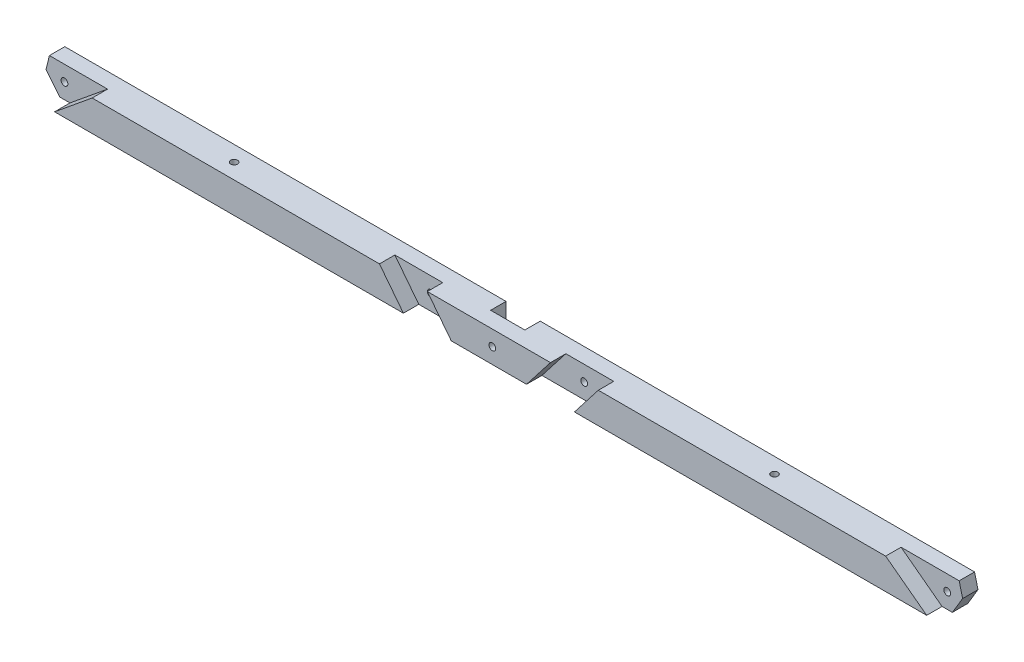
ISO-10303-21;
HEADER;
FILE_DESCRIPTION(('STEP AP214'),'2;1');
FILE_NAME('part.step','',(''),(''),'','','');
FILE_SCHEMA(('AUTOMOTIVE_DESIGN { 1 0 10303 214 1 1 1 1 }'));
ENDSEC;
DATA;
#1=APPLICATION_CONTEXT('core data for automotive mechanical design processes');
#2=APPLICATION_PROTOCOL_DEFINITION('international standard','automotive_design',2000,#1);
#3=PRODUCT_CONTEXT('',#1,'mechanical');
#4=PRODUCT('Part','Part','',(#3));
#5=PRODUCT_RELATED_PRODUCT_CATEGORY('part','',(#4));
#6=PRODUCT_DEFINITION_FORMATION('','',#4);
#7=PRODUCT_DEFINITION_CONTEXT('part definition',#1,'design');
#8=PRODUCT_DEFINITION('design','',#6,#7);
#9=PRODUCT_DEFINITION_SHAPE('','',#8);
#10=(LENGTH_UNIT() NAMED_UNIT(*) SI_UNIT(.MILLI.,.METRE.));
#11=(NAMED_UNIT(*) PLANE_ANGLE_UNIT() SI_UNIT($,.RADIAN.));
#12=(NAMED_UNIT(*) SI_UNIT($,.STERADIAN.) SOLID_ANGLE_UNIT());
#13=UNCERTAINTY_MEASURE_WITH_UNIT(LENGTH_MEASURE(1.E-05),#10,'distance_accuracy_value','');
#14=(GEOMETRIC_REPRESENTATION_CONTEXT(3) GLOBAL_UNCERTAINTY_ASSIGNED_CONTEXT((#13)) GLOBAL_UNIT_ASSIGNED_CONTEXT((#10,
#11,#12)) REPRESENTATION_CONTEXT('',''));
#15=CARTESIAN_POINT('',(0.,0.,0.));
#16=DIRECTION('',(0.,0.,1.));
#17=DIRECTION('',(1.,0.,0.));
#18=AXIS2_PLACEMENT_3D('',#15,#16,#17);
#19=CARTESIAN_POINT('',(0.,9.,0.));
#20=DIRECTION('',(0.,0.,-1.));
#21=DIRECTION('',(-1.,0.,0.));
#22=AXIS2_PLACEMENT_3D('',#19,#20,#21);
#23=PLANE('',#22);
#24=DIRECTION('',(0.,-1.,0.));
#25=VECTOR('',#24,1.);
#26=CARTESIAN_POINT('',(140.,0.,0.));
#27=LINE('',#26,#25);
#28=CARTESIAN_POINT('',(140.,9.,0.));
#29=VERTEX_POINT('',#28);
#30=CARTESIAN_POINT('',(140.,0.,0.));
#31=VERTEX_POINT('',#30);
#32=EDGE_CURVE('E187',#29,#31,#27,.T.);
#33=ORIENTED_EDGE('',*,*,#32,.F.);
#34=DIRECTION('',(-1.,0.,0.));
#35=VECTOR('',#34,1.);
#36=CARTESIAN_POINT('',(0.,9.,0.));
#37=LINE('',#36,#35);
#38=CARTESIAN_POINT('',(267.,9.,0.));
#39=VERTEX_POINT('',#38);
#40=EDGE_CURVE('E35',#39,#29,#37,.T.);
#41=ORIENTED_EDGE('',*,*,#40,.F.);
#42=DIRECTION('',(0.242535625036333,-0.970142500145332,0.));
#43=VECTOR('',#42,1.);
#44=CARTESIAN_POINT('',(268.,5.,0.));
#45=LINE('',#44,#43);
#46=CARTESIAN_POINT('',(268.,5.,0.));
#47=VERTEX_POINT('',#46);
#48=EDGE_CURVE('E240',#39,#47,#45,.T.);
#49=ORIENTED_EDGE('',*,*,#48,.T.);
#50=DIRECTION('',(-0.514495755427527,-0.857492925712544,0.));
#51=VECTOR('',#50,1.);
#52=CARTESIAN_POINT('',(268.,5.,0.));
#53=LINE('',#52,#51);
#54=CARTESIAN_POINT('',(265.,0.,0.));
#55=VERTEX_POINT('',#54);
#56=EDGE_CURVE('E247',#47,#55,#53,.T.);
#57=ORIENTED_EDGE('',*,*,#56,.T.);
#58=DIRECTION('',(1.,0.,0.));
#59=VECTOR('',#58,1.);
#60=CARTESIAN_POINT('',(0.,0.,0.));
#61=LINE('',#60,#59);
#62=EDGE_CURVE('E356',#31,#55,#61,.T.);
#63=ORIENTED_EDGE('',*,*,#62,.F.);
#64=EDGE_LOOP('',(#33,#41,#49,#57,#63));
#65=FACE_BOUND('',#64,.T.);
#66=CARTESIAN_POINT('',(157.368031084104,4.5,0.));
#67=DIRECTION('',(0.,0.,1.));
#68=DIRECTION('',(1.,0.,0.));
#69=AXIS2_PLACEMENT_3D('',#66,#67,#68);
#70=CIRCLE('',#69,0.999999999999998);
#71=CARTESIAN_POINT('',(158.368031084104,4.5,0.));
#72=VERTEX_POINT('',#71);
#73=EDGE_CURVE('E330',#72,#72,#70,.T.);
#74=ORIENTED_EDGE('',*,*,#73,.T.);
#75=EDGE_LOOP('',(#74));
#76=FACE_BOUND('',#75,.T.);
#77=CARTESIAN_POINT('',(263.5,4.5,0.));
#78=DIRECTION('',(0.,0.,1.));
#79=DIRECTION('',(1.,0.,0.));
#80=AXIS2_PLACEMENT_3D('',#77,#78,#79);
#81=CIRCLE('',#80,0.999999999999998);
#82=CARTESIAN_POINT('',(264.5,4.5,0.));
#83=VERTEX_POINT('',#82);
#84=EDGE_CURVE('E219',#83,#83,#81,.T.);
#85=ORIENTED_EDGE('',*,*,#84,.T.);
#86=EDGE_LOOP('',(#85));
#87=FACE_BOUND('',#86,.T.);
#88=ADVANCED_FACE('F31',(#65,#76,#87),#23,.T.);
#89=CARTESIAN_POINT('',(268.,5.,0.));
#90=DIRECTION('',(-0.857492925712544,0.514495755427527,0.));
#91=DIRECTION('',(-0.514495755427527,-0.857492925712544,0.));
#92=AXIS2_PLACEMENT_3D('',#89,#90,#91);
#93=PLANE('',#92);
#94=DIRECTION('',(0.514495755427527,0.857492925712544,0.));
#95=VECTOR('',#94,1.);
#96=CARTESIAN_POINT('',(265.,0.,4.5));
#97=LINE('',#96,#95);
#98=CARTESIAN_POINT('',(265.,0.,4.5));
#99=VERTEX_POINT('',#98);
#100=CARTESIAN_POINT('',(268.,5.,4.5));
#101=VERTEX_POINT('',#100);
#102=EDGE_CURVE('E57',#99,#101,#97,.T.);
#103=ORIENTED_EDGE('',*,*,#102,.F.);
#104=DIRECTION('',(0.,0.,1.));
#105=VECTOR('',#104,1.);
#106=CARTESIAN_POINT('',(265.,0.,0.));
#107=LINE('',#106,#105);
#108=EDGE_CURVE('E251',#55,#99,#107,.T.);
#109=ORIENTED_EDGE('',*,*,#108,.F.);
#110=ORIENTED_EDGE('',*,*,#56,.F.);
#111=DIRECTION('',(0.,0.,1.));
#112=VECTOR('',#111,1.);
#113=CARTESIAN_POINT('',(268.,5.,0.));
#114=LINE('',#113,#112);
#115=EDGE_CURVE('E250',#47,#101,#114,.T.);
#116=ORIENTED_EDGE('',*,*,#115,.T.);
#117=EDGE_LOOP('',(#103,#109,#110,#116));
#118=FACE_BOUND('',#117,.T.);
#119=ADVANCED_FACE('F376',(#118),#93,.F.);
#120=CARTESIAN_POINT('',(268.,5.,0.));
#121=DIRECTION('',(-0.970142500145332,-0.242535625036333,0.));
#122=DIRECTION('',(0.242535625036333,-0.970142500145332,0.));
#123=AXIS2_PLACEMENT_3D('',#120,#121,#122);
#124=PLANE('',#123);
#125=DIRECTION('',(-0.242535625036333,0.970142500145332,0.));
#126=VECTOR('',#125,1.);
#127=CARTESIAN_POINT('',(268.,5.,4.5));
#128=LINE('',#127,#126);
#129=CARTESIAN_POINT('',(267.,9.,4.5));
#130=VERTEX_POINT('',#129);
#131=EDGE_CURVE('E228',#101,#130,#128,.T.);
#132=ORIENTED_EDGE('',*,*,#131,.F.);
#133=ORIENTED_EDGE('',*,*,#115,.F.);
#134=ORIENTED_EDGE('',*,*,#48,.F.);
#135=DIRECTION('',(0.,0.,1.));
#136=VECTOR('',#135,1.);
#137=CARTESIAN_POINT('',(267.,9.,0.));
#138=LINE('',#137,#136);
#139=EDGE_CURVE('E244',#39,#130,#138,.T.);
#140=ORIENTED_EDGE('',*,*,#139,.T.);
#141=EDGE_LOOP('',(#132,#133,#134,#140));
#142=FACE_BOUND('',#141,.T.);
#143=ADVANCED_FACE('F382',(#142),#124,.F.);
#144=CARTESIAN_POINT('',(4.,0.,0.));
#145=DIRECTION('',(0.78086880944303,0.624695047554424,0.));
#146=DIRECTION('',(-0.624695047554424,0.78086880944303,0.));
#147=AXIS2_PLACEMENT_3D('',#144,#145,#146);
#148=PLANE('',#147);
#149=DIRECTION('',(0.624695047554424,-0.78086880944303,0.));
#150=VECTOR('',#149,1.);
#151=CARTESIAN_POINT('',(4.,0.,4.5));
#152=LINE('',#151,#150);
#153=CARTESIAN_POINT('',(0.,5.,4.5));
#154=VERTEX_POINT('',#153);
#155=CARTESIAN_POINT('',(4.,0.,4.5));
#156=VERTEX_POINT('',#155);
#157=EDGE_CURVE('E265',#154,#156,#152,.T.);
#158=ORIENTED_EDGE('',*,*,#157,.F.);
#159=DIRECTION('',(0.,0.,1.));
#160=VECTOR('',#159,1.);
#161=CARTESIAN_POINT('',(0.,5.,0.));
#162=LINE('',#161,#160);
#163=CARTESIAN_POINT('',(0.,5.,0.));
#164=VERTEX_POINT('',#163);
#165=EDGE_CURVE('E291',#164,#154,#162,.T.);
#166=ORIENTED_EDGE('',*,*,#165,.F.);
#167=DIRECTION('',(-0.624695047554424,0.78086880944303,0.));
#168=VECTOR('',#167,1.);
#169=CARTESIAN_POINT('',(4.,0.,0.));
#170=LINE('',#169,#168);
#171=CARTESIAN_POINT('',(4.,0.,0.));
#172=VERTEX_POINT('',#171);
#173=EDGE_CURVE('E287',#172,#164,#170,.T.);
#174=ORIENTED_EDGE('',*,*,#173,.F.);
#175=DIRECTION('',(0.,0.,1.));
#176=VECTOR('',#175,1.);
#177=CARTESIAN_POINT('',(4.,0.,0.));
#178=LINE('',#177,#176);
#179=EDGE_CURVE('E290',#172,#156,#178,.T.);
#180=ORIENTED_EDGE('',*,*,#179,.T.);
#181=EDGE_LOOP('',(#158,#166,#174,#180));
#182=FACE_BOUND('',#181,.T.);
#183=ADVANCED_FACE('F506',(#182),#148,.F.);
#184=CARTESIAN_POINT('',(0.,5.,0.));
#185=DIRECTION('',(0.970142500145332,-0.242535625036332,0.));
#186=DIRECTION('',(0.242535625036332,0.970142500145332,0.));
#187=AXIS2_PLACEMENT_3D('',#184,#185,#186);
#188=PLANE('',#187);
#189=DIRECTION('',(-0.242535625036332,-0.970142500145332,0.));
#190=VECTOR('',#189,1.);
#191=CARTESIAN_POINT('',(0.,5.,4.5));
#192=LINE('',#191,#190);
#193=CARTESIAN_POINT('',(1.,9.00000000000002,4.5));
#194=VERTEX_POINT('',#193);
#195=EDGE_CURVE('E263',#194,#154,#192,.T.);
#196=ORIENTED_EDGE('',*,*,#195,.F.);
#197=DIRECTION('',(0.,0.,1.));
#198=VECTOR('',#197,1.);
#199=CARTESIAN_POINT('',(1.,9.00000000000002,0.));
#200=LINE('',#199,#198);
#201=CARTESIAN_POINT('',(1.,9.00000000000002,0.));
#202=VERTEX_POINT('',#201);
#203=EDGE_CURVE('E284',#202,#194,#200,.T.);
#204=ORIENTED_EDGE('',*,*,#203,.F.);
#205=DIRECTION('',(0.242535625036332,0.970142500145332,0.));
#206=VECTOR('',#205,1.);
#207=CARTESIAN_POINT('',(0.,5.,0.));
#208=LINE('',#207,#206);
#209=EDGE_CURVE('E280',#164,#202,#208,.T.);
#210=ORIENTED_EDGE('',*,*,#209,.F.);
#211=ORIENTED_EDGE('',*,*,#165,.T.);
#212=EDGE_LOOP('',(#196,#204,#210,#211));
#213=FACE_BOUND('',#212,.T.);
#214=ADVANCED_FACE('F518',(#213),#188,.F.);
#215=CARTESIAN_POINT('',(0.,9.,9.));
#216=DIRECTION('',(0.,0.,-1.));
#217=DIRECTION('',(-1.,0.,0.));
#218=AXIS2_PLACEMENT_3D('',#215,#216,#217);
#219=PLANE('',#218);
#220=CARTESIAN_POINT('',(135.,4.5,9.));
#221=DIRECTION('',(0.,0.,-1.));
#222=DIRECTION('',(-1.,0.,0.));
#223=AXIS2_PLACEMENT_3D('',#220,#221,#222);
#224=CIRCLE('',#223,0.999999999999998);
#225=CARTESIAN_POINT('',(134.,4.5,9.));
#226=VERTEX_POINT('',#225);
#227=EDGE_CURVE('E210',#226,#226,#224,.T.);
#228=ORIENTED_EDGE('',*,*,#227,.T.);
#229=EDGE_LOOP('',(#228));
#230=FACE_BOUND('',#229,.T.);
#231=DIRECTION('',(1.,0.,0.));
#232=VECTOR('',#231,1.);
#233=CARTESIAN_POINT('',(0.,0.,9.));
#234=LINE('',#233,#232);
#235=CARTESIAN_POINT('',(123.,0.,9.));
#236=VERTEX_POINT('',#235);
#237=CARTESIAN_POINT('',(145.,0.,9.));
#238=VERTEX_POINT('',#237);
#239=EDGE_CURVE('E365',#236,#238,#234,.T.);
#240=ORIENTED_EDGE('',*,*,#239,.T.);
#241=DIRECTION('',(-0.613940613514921,-0.789352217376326,0.));
#242=VECTOR('',#241,1.);
#243=CARTESIAN_POINT('',(145.,0.,9.));
#244=LINE('',#243,#242);
#245=CARTESIAN_POINT('',(152.,9.,9.));
#246=VERTEX_POINT('',#245);
#247=EDGE_CURVE('E333',#246,#238,#244,.T.);
#248=ORIENTED_EDGE('',*,*,#247,.F.);
#249=DIRECTION('',(-1.,0.,0.));
#250=VECTOR('',#249,1.);
#251=CARTESIAN_POINT('',(0.,9.,9.));
#252=LINE('',#251,#250);
#253=CARTESIAN_POINT('',(116.,9.00000000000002,9.));
#254=VERTEX_POINT('',#253);
#255=EDGE_CURVE('E40',#246,#254,#252,.T.);
#256=ORIENTED_EDGE('',*,*,#255,.T.);
#257=DIRECTION('',(-0.613940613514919,0.789352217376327,0.));
#258=VECTOR('',#257,1.);
#259=CARTESIAN_POINT('',(123.,0.,9.));
#260=LINE('',#259,#258);
#261=EDGE_CURVE('E300',#236,#254,#260,.T.);
#262=ORIENTED_EDGE('',*,*,#261,.F.);
#263=EDGE_LOOP('',(#240,#248,#256,#262));
#264=FACE_BOUND('',#263,.T.);
#265=ADVANCED_FACE('F403',(#230,#264),#219,.F.);
#266=CARTESIAN_POINT('',(102.,9.00000000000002,9.));
#267=VERTEX_POINT('',#266);
#268=CARTESIAN_POINT('',(18.,9.00000000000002,9.));
#269=VERTEX_POINT('',#268);
#270=EDGE_CURVE('E42',#267,#269,#252,.T.);
#271=ORIENTED_EDGE('',*,*,#270,.T.);
#272=DIRECTION('',(0.77395729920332,0.633237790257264,0.));
#273=VECTOR('',#272,1.);
#274=CARTESIAN_POINT('',(18.,9.00000000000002,9.));
#275=LINE('',#274,#273);
#276=CARTESIAN_POINT('',(7.,0.,9.));
#277=VERTEX_POINT('',#276);
#278=EDGE_CURVE('E260',#277,#269,#275,.T.);
#279=ORIENTED_EDGE('',*,*,#278,.F.);
#280=CARTESIAN_POINT('',(109.,0.,9.));
#281=VERTEX_POINT('',#280);
#282=EDGE_CURVE('E364',#277,#281,#234,.T.);
#283=ORIENTED_EDGE('',*,*,#282,.T.);
#284=DIRECTION('',(0.613940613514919,-0.789352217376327,0.));
#285=VECTOR('',#284,1.);
#286=CARTESIAN_POINT('',(102.,9.00000000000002,9.));
#287=LINE('',#286,#285);
#288=EDGE_CURVE('E306',#267,#281,#287,.T.);
#289=ORIENTED_EDGE('',*,*,#288,.F.);
#290=EDGE_LOOP('',(#271,#279,#283,#289));
#291=FACE_BOUND('',#290,.T.);
#292=ADVANCED_FACE('F423',(#291),#219,.F.);
#293=CARTESIAN_POINT('',(0.,0.,9.));
#294=DIRECTION('',(0.,1.,0.));
#295=DIRECTION('',(0.,0.,1.));
#296=AXIS2_PLACEMENT_3D('',#293,#294,#295);
#297=PLANE('',#296);
#298=CARTESIAN_POINT('',(213.,0.,4.5));
#299=DIRECTION('',(0.,1.,0.));
#300=DIRECTION('',(0.,0.,1.));
#301=AXIS2_PLACEMENT_3D('',#298,#299,#300);
#302=CIRCLE('',#301,0.999999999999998);
#303=CARTESIAN_POINT('',(213.,0.,5.5));
#304=VERTEX_POINT('',#303);
#305=EDGE_CURVE('E557',#304,#304,#302,.T.);
#306=ORIENTED_EDGE('',*,*,#305,.T.);
#307=EDGE_LOOP('',(#306));
#308=FACE_BOUND('',#307,.T.);
#309=CARTESIAN_POINT('',(55.,0.,4.5));
#310=DIRECTION('',(0.,1.,0.));
#311=DIRECTION('',(0.,0.,1.));
#312=AXIS2_PLACEMENT_3D('',#309,#310,#311);
#313=CIRCLE('',#312,0.999999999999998);
#314=CARTESIAN_POINT('',(55.,0.,5.5));
#315=VERTEX_POINT('',#314);
#316=EDGE_CURVE('E566',#315,#315,#313,.T.);
#317=ORIENTED_EDGE('',*,*,#316,.T.);
#318=EDGE_LOOP('',(#317));
#319=FACE_BOUND('',#318,.T.);
#320=DIRECTION('',(-1.,0.,0.));
#321=VECTOR('',#320,1.);
#322=CARTESIAN_POINT('',(140.,0.,4.5));
#323=LINE('',#322,#321);
#324=CARTESIAN_POINT('',(140.,0.,4.5));
#325=VERTEX_POINT('',#324);
#326=CARTESIAN_POINT('',(130.,0.,4.5));
#327=VERTEX_POINT('',#326);
#328=EDGE_CURVE('E197',#325,#327,#323,.T.);
#329=ORIENTED_EDGE('',*,*,#328,.F.);
#330=DIRECTION('',(0.,0.,-1.));
#331=VECTOR('',#330,1.);
#332=CARTESIAN_POINT('',(140.,0.,4.5));
#333=LINE('',#332,#331);
#334=EDGE_CURVE('E181',#325,#31,#333,.T.);
#335=ORIENTED_EDGE('',*,*,#334,.T.);
#336=ORIENTED_EDGE('',*,*,#62,.T.);
#337=ORIENTED_EDGE('',*,*,#108,.T.);
#338=DIRECTION('',(1.,0.,0.));
#339=VECTOR('',#338,1.);
#340=CARTESIAN_POINT('',(262.,0.,4.5));
#341=LINE('',#340,#339);
#342=CARTESIAN_POINT('',(262.,0.,4.5));
#343=VERTEX_POINT('',#342);
#344=EDGE_CURVE('E225',#343,#99,#341,.T.);
#345=ORIENTED_EDGE('',*,*,#344,.F.);
#346=DIRECTION('',(0.,0.,1.));
#347=VECTOR('',#346,1.);
#348=CARTESIAN_POINT('',(262.,0.,4.5));
#349=LINE('',#348,#347);
#350=CARTESIAN_POINT('',(262.,0.,9.));
#351=VERTEX_POINT('',#350);
#352=EDGE_CURVE('E237',#343,#351,#349,.T.);
#353=ORIENTED_EDGE('',*,*,#352,.T.);
#354=CARTESIAN_POINT('',(159.,0.,9.));
#355=VERTEX_POINT('',#354);
#356=EDGE_CURVE('E366',#355,#351,#234,.T.);
#357=ORIENTED_EDGE('',*,*,#356,.F.);
#358=DIRECTION('',(0.,0.,1.));
#359=VECTOR('',#358,1.);
#360=CARTESIAN_POINT('',(159.,0.,4.5));
#361=LINE('',#360,#359);
#362=CARTESIAN_POINT('',(159.,0.,4.5));
#363=VERTEX_POINT('',#362);
#364=EDGE_CURVE('E360',#363,#355,#361,.T.);
#365=ORIENTED_EDGE('',*,*,#364,.F.);
#366=DIRECTION('',(1.,0.,0.));
#367=VECTOR('',#366,1.);
#368=CARTESIAN_POINT('',(159.,0.,4.5));
#369=LINE('',#368,#367);
#370=CARTESIAN_POINT('',(145.,0.,4.5));
#371=VERTEX_POINT('',#370);
#372=EDGE_CURVE('E339',#371,#363,#369,.T.);
#373=ORIENTED_EDGE('',*,*,#372,.F.);
#374=DIRECTION('',(0.,0.,1.));
#375=VECTOR('',#374,1.);
#376=CARTESIAN_POINT('',(145.,0.,4.5));
#377=LINE('',#376,#375);
#378=EDGE_CURVE('E349',#371,#238,#377,.T.);
#379=ORIENTED_EDGE('',*,*,#378,.T.);
#380=ORIENTED_EDGE('',*,*,#239,.F.);
#381=DIRECTION('',(0.,0.,1.));
#382=VECTOR('',#381,1.);
#383=CARTESIAN_POINT('',(123.,0.,4.5));
#384=LINE('',#383,#382);
#385=CARTESIAN_POINT('',(123.,0.,4.5));
#386=VERTEX_POINT('',#385);
#387=EDGE_CURVE('E319',#386,#236,#384,.T.);
#388=ORIENTED_EDGE('',*,*,#387,.F.);
#389=DIRECTION('',(1.,0.,0.));
#390=VECTOR('',#389,1.);
#391=CARTESIAN_POINT('',(109.,0.,4.5));
#392=LINE('',#391,#390);
#393=CARTESIAN_POINT('',(109.,0.,4.5));
#394=VERTEX_POINT('',#393);
#395=EDGE_CURVE('E312',#394,#386,#392,.T.);
#396=ORIENTED_EDGE('',*,*,#395,.F.);
#397=DIRECTION('',(0.,0.,1.));
#398=VECTOR('',#397,1.);
#399=CARTESIAN_POINT('',(109.,0.,4.5));
#400=LINE('',#399,#398);
#401=EDGE_CURVE('E323',#394,#281,#400,.T.);
#402=ORIENTED_EDGE('',*,*,#401,.T.);
#403=ORIENTED_EDGE('',*,*,#282,.F.);
#404=DIRECTION('',(0.,0.,1.));
#405=VECTOR('',#404,1.);
#406=CARTESIAN_POINT('',(7.,0.,4.5));
#407=LINE('',#406,#405);
#408=CARTESIAN_POINT('',(7.,0.,4.5));
#409=VERTEX_POINT('',#408);
#410=EDGE_CURVE('E275',#409,#277,#407,.T.);
#411=ORIENTED_EDGE('',*,*,#410,.F.);
#412=DIRECTION('',(1.,0.,0.));
#413=VECTOR('',#412,1.);
#414=CARTESIAN_POINT('',(7.,0.,4.5));
#415=LINE('',#414,#413);
#416=EDGE_CURVE('E267',#156,#409,#415,.T.);
#417=ORIENTED_EDGE('',*,*,#416,.F.);
#418=ORIENTED_EDGE('',*,*,#179,.F.);
#419=CARTESIAN_POINT('',(130.,0.,0.));
#420=VERTEX_POINT('',#419);
#421=EDGE_CURVE('E367',#172,#420,#61,.T.);
#422=ORIENTED_EDGE('',*,*,#421,.T.);
#423=DIRECTION('',(0.,0.,-1.));
#424=VECTOR('',#423,1.);
#425=CARTESIAN_POINT('',(130.,0.,4.5));
#426=LINE('',#425,#424);
#427=EDGE_CURVE('E49',#327,#420,#426,.T.);
#428=ORIENTED_EDGE('',*,*,#427,.F.);
#429=EDGE_LOOP('',(#329,#335,#336,#337,#345,#353,#357,#365,#373,#379,#380,#388,#396,#402,#403,
#411,#417,#418,#422,#428));
#430=FACE_BOUND('',#429,.T.);
#431=ADVANCED_FACE('F33',(#308,#319,#430),#297,.F.);
#432=CARTESIAN_POINT('',(0.,9.,9.));
#433=DIRECTION('',(0.,-1.,0.));
#434=DIRECTION('',(0.,0.,-1.));
#435=AXIS2_PLACEMENT_3D('',#432,#433,#434);
#436=PLANE('',#435);
#437=CARTESIAN_POINT('',(213.,9.,4.5));
#438=DIRECTION('',(0.,1.,0.));
#439=DIRECTION('',(0.,0.,1.));
#440=AXIS2_PLACEMENT_3D('',#437,#438,#439);
#441=CIRCLE('',#440,0.999999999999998);
#442=CARTESIAN_POINT('',(213.,9.,5.5));
#443=VERTEX_POINT('',#442);
#444=EDGE_CURVE('E560',#443,#443,#441,.T.);
#445=ORIENTED_EDGE('',*,*,#444,.F.);
#446=EDGE_LOOP('',(#445));
#447=FACE_BOUND('',#446,.T.);
#448=CARTESIAN_POINT('',(55.,9.,4.5));
#449=DIRECTION('',(0.,1.,0.));
#450=DIRECTION('',(0.,0.,1.));
#451=AXIS2_PLACEMENT_3D('',#448,#449,#450);
#452=CIRCLE('',#451,0.999999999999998);
#453=CARTESIAN_POINT('',(55.,9.,5.5));
#454=VERTEX_POINT('',#453);
#455=EDGE_CURVE('E563',#454,#454,#452,.T.);
#456=ORIENTED_EDGE('',*,*,#455,.F.);
#457=EDGE_LOOP('',(#456));
#458=FACE_BOUND('',#457,.T.);
#459=ORIENTED_EDGE('',*,*,#40,.T.);
#460=DIRECTION('',(0.,0.,-1.));
#461=VECTOR('',#460,1.);
#462=CARTESIAN_POINT('',(140.,9.,4.5));
#463=LINE('',#462,#461);
#464=CARTESIAN_POINT('',(140.,9.,4.5));
#465=VERTEX_POINT('',#464);
#466=EDGE_CURVE('E212',#465,#29,#463,.T.);
#467=ORIENTED_EDGE('',*,*,#466,.F.);
#468=DIRECTION('',(1.,0.,0.));
#469=VECTOR('',#468,1.);
#470=CARTESIAN_POINT('',(140.,9.,4.5));
#471=LINE('',#470,#469);
#472=CARTESIAN_POINT('',(130.,9.,4.5));
#473=VERTEX_POINT('',#472);
#474=EDGE_CURVE('E191',#473,#465,#471,.T.);
#475=ORIENTED_EDGE('',*,*,#474,.F.);
#476=DIRECTION('',(0.,0.,-1.));
#477=VECTOR('',#476,1.);
#478=CARTESIAN_POINT('',(130.,9.,4.5));
#479=LINE('',#478,#477);
#480=CARTESIAN_POINT('',(130.,9.,0.));
#481=VERTEX_POINT('',#480);
#482=EDGE_CURVE('E215',#473,#481,#479,.T.);
#483=ORIENTED_EDGE('',*,*,#482,.T.);
#484=EDGE_CURVE('E368',#481,#202,#37,.T.);
#485=ORIENTED_EDGE('',*,*,#484,.T.);
#486=ORIENTED_EDGE('',*,*,#203,.T.);
#487=DIRECTION('',(-1.,0.,0.));
#488=VECTOR('',#487,1.);
#489=CARTESIAN_POINT('',(1.,9.00000000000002,4.5));
#490=LINE('',#489,#488);
#491=CARTESIAN_POINT('',(18.,9.00000000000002,4.5));
#492=VERTEX_POINT('',#491);
#493=EDGE_CURVE('E273',#492,#194,#490,.T.);
#494=ORIENTED_EDGE('',*,*,#493,.F.);
#495=DIRECTION('',(0.,0.,1.));
#496=VECTOR('',#495,1.);
#497=CARTESIAN_POINT('',(18.,9.00000000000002,4.5));
#498=LINE('',#497,#496);
#499=EDGE_CURVE('E277',#492,#269,#498,.T.);
#500=ORIENTED_EDGE('',*,*,#499,.T.);
#501=ORIENTED_EDGE('',*,*,#270,.F.);
#502=DIRECTION('',(0.,0.,1.));
#503=VECTOR('',#502,1.);
#504=CARTESIAN_POINT('',(102.,9.00000000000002,4.5));
#505=LINE('',#504,#503);
#506=CARTESIAN_POINT('',(102.,9.00000000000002,4.5));
#507=VERTEX_POINT('',#506);
#508=EDGE_CURVE('E326',#507,#267,#505,.T.);
#509=ORIENTED_EDGE('',*,*,#508,.F.);
#510=DIRECTION('',(-1.,0.,0.));
#511=VECTOR('',#510,1.);
#512=CARTESIAN_POINT('',(116.,9.00000000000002,4.5));
#513=LINE('',#512,#511);
#514=CARTESIAN_POINT('',(116.,9.,4.5));
#515=VERTEX_POINT('',#514);
#516=EDGE_CURVE('E305',#515,#507,#513,.T.);
#517=ORIENTED_EDGE('',*,*,#516,.F.);
#518=DIRECTION('',(0.,0.,1.));
#519=VECTOR('',#518,1.);
#520=CARTESIAN_POINT('',(116.,9.00000000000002,4.5));
#521=LINE('',#520,#519);
#522=EDGE_CURVE('E315',#515,#254,#521,.T.);
#523=ORIENTED_EDGE('',*,*,#522,.T.);
#524=ORIENTED_EDGE('',*,*,#255,.F.);
#525=DIRECTION('',(0.,0.,1.));
#526=VECTOR('',#525,1.);
#527=CARTESIAN_POINT('',(152.,9.,4.5));
#528=LINE('',#527,#526);
#529=CARTESIAN_POINT('',(152.,9.,4.5));
#530=VERTEX_POINT('',#529);
#531=EDGE_CURVE('E353',#530,#246,#528,.T.);
#532=ORIENTED_EDGE('',*,*,#531,.F.);
#533=DIRECTION('',(-1.,0.,0.));
#534=VECTOR('',#533,1.);
#535=CARTESIAN_POINT('',(152.,9.,4.5));
#536=LINE('',#535,#534);
#537=CARTESIAN_POINT('',(166.,9.,4.5));
#538=VERTEX_POINT('',#537);
#539=EDGE_CURVE('E346',#538,#530,#536,.T.);
#540=ORIENTED_EDGE('',*,*,#539,.F.);
#541=DIRECTION('',(0.,0.,1.));
#542=VECTOR('',#541,1.);
#543=CARTESIAN_POINT('',(166.,9.,4.5));
#544=LINE('',#543,#542);
#545=CARTESIAN_POINT('',(166.,9.,9.));
#546=VERTEX_POINT('',#545);
#547=EDGE_CURVE('E357',#538,#546,#544,.T.);
#548=ORIENTED_EDGE('',*,*,#547,.T.);
#549=CARTESIAN_POINT('',(250.,9.,9.));
#550=VERTEX_POINT('',#549);
#551=EDGE_CURVE('E11',#550,#546,#252,.T.);
#552=ORIENTED_EDGE('',*,*,#551,.F.);
#553=DIRECTION('',(0.,0.,1.));
#554=VECTOR('',#553,1.);
#555=CARTESIAN_POINT('',(250.,9.,4.5));
#556=LINE('',#555,#554);
#557=CARTESIAN_POINT('',(250.,9.,4.5));
#558=VERTEX_POINT('',#557);
#559=EDGE_CURVE('E235',#558,#550,#556,.T.);
#560=ORIENTED_EDGE('',*,*,#559,.F.);
#561=DIRECTION('',(-1.,0.,0.));
#562=VECTOR('',#561,1.);
#563=CARTESIAN_POINT('',(267.,9.,4.5));
#564=LINE('',#563,#562);
#565=EDGE_CURVE('E230',#130,#558,#564,.T.);
#566=ORIENTED_EDGE('',*,*,#565,.F.);
#567=ORIENTED_EDGE('',*,*,#139,.F.);
#568=EDGE_LOOP('',(#459,#467,#475,#483,#485,#486,#494,#500,#501,#509,#517,#523,#524,#532,#540,
#548,#552,#560,#566,#567));
#569=FACE_BOUND('',#568,.T.);
#570=ADVANCED_FACE('F385',(#447,#458,#569),#436,.F.);
#571=ORIENTED_EDGE('',*,*,#356,.T.);
#572=DIRECTION('',(0.8,-0.6,0.));
#573=VECTOR('',#572,1.);
#574=CARTESIAN_POINT('',(250.,9.,9.));
#575=LINE('',#574,#573);
#576=EDGE_CURVE('E222',#550,#351,#575,.T.);
#577=ORIENTED_EDGE('',*,*,#576,.F.);
#578=ORIENTED_EDGE('',*,*,#551,.T.);
#579=DIRECTION('',(0.613940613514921,0.789352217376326,0.));
#580=VECTOR('',#579,1.);
#581=CARTESIAN_POINT('',(166.,9.,9.));
#582=LINE('',#581,#580);
#583=EDGE_CURVE('E340',#355,#546,#582,.T.);
#584=ORIENTED_EDGE('',*,*,#583,.F.);
#585=EDGE_LOOP('',(#571,#577,#578,#584));
#586=FACE_BOUND('',#585,.T.);
#587=ADVANCED_FACE('F398',(#586),#219,.F.);
#588=DIRECTION('',(0.,1.,0.));
#589=VECTOR('',#588,1.);
#590=CARTESIAN_POINT('',(130.,0.,0.));
#591=LINE('',#590,#589);
#592=EDGE_CURVE('E200',#420,#481,#591,.T.);
#593=ORIENTED_EDGE('',*,*,#592,.F.);
#594=ORIENTED_EDGE('',*,*,#421,.F.);
#595=ORIENTED_EDGE('',*,*,#173,.T.);
#596=ORIENTED_EDGE('',*,*,#209,.T.);
#597=ORIENTED_EDGE('',*,*,#484,.F.);
#598=EDGE_LOOP('',(#593,#594,#595,#596,#597));
#599=FACE_BOUND('',#598,.T.);
#600=CARTESIAN_POINT('',(5.39366479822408,4.50000000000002,0.));
#601=DIRECTION('',(0.,0.,1.));
#602=DIRECTION('',(1.,0.,0.));
#603=AXIS2_PLACEMENT_3D('',#600,#601,#602);
#604=CIRCLE('',#603,1.);
#605=CARTESIAN_POINT('',(6.39366479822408,4.50000000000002,0.));
#606=VERTEX_POINT('',#605);
#607=EDGE_CURVE('E257',#606,#606,#604,.T.);
#608=ORIENTED_EDGE('',*,*,#607,.T.);
#609=EDGE_LOOP('',(#608));
#610=FACE_BOUND('',#609,.T.);
#611=CARTESIAN_POINT('',(112.5,4.5,0.));
#612=DIRECTION('',(0.,0.,1.));
#613=DIRECTION('',(1.,0.,0.));
#614=AXIS2_PLACEMENT_3D('',#611,#612,#613);
#615=CIRCLE('',#614,0.999999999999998);
#616=CARTESIAN_POINT('',(113.5,4.5,0.));
#617=VERTEX_POINT('',#616);
#618=EDGE_CURVE('E297',#617,#617,#615,.T.);
#619=ORIENTED_EDGE('',*,*,#618,.T.);
#620=EDGE_LOOP('',(#619));
#621=FACE_BOUND('',#620,.T.);
#622=ADVANCED_FACE('F443',(#599,#610,#621),#23,.T.);
#623=CARTESIAN_POINT('',(145.,0.,4.5));
#624=DIRECTION('',(-0.789352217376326,0.613940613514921,0.));
#625=DIRECTION('',(-0.613940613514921,-0.789352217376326,0.));
#626=AXIS2_PLACEMENT_3D('',#623,#624,#625);
#627=PLANE('',#626);
#628=ORIENTED_EDGE('',*,*,#247,.T.);
#629=ORIENTED_EDGE('',*,*,#378,.F.);
#630=DIRECTION('',(-0.613940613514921,-0.789352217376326,0.));
#631=VECTOR('',#630,1.);
#632=CARTESIAN_POINT('',(145.,0.,4.5));
#633=LINE('',#632,#631);
#634=EDGE_CURVE('E336',#530,#371,#633,.T.);
#635=ORIENTED_EDGE('',*,*,#634,.F.);
#636=ORIENTED_EDGE('',*,*,#531,.T.);
#637=EDGE_LOOP('',(#628,#629,#635,#636));
#638=FACE_BOUND('',#637,.T.);
#639=ADVANCED_FACE('F429',(#638),#627,.F.);
#640=CARTESIAN_POINT('',(166.,9.,4.5));
#641=DIRECTION('',(0.789352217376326,-0.613940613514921,0.));
#642=DIRECTION('',(0.613940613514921,0.789352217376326,0.));
#643=AXIS2_PLACEMENT_3D('',#640,#641,#642);
#644=PLANE('',#643);
#645=ORIENTED_EDGE('',*,*,#583,.T.);
#646=ORIENTED_EDGE('',*,*,#547,.F.);
#647=DIRECTION('',(0.613940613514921,0.789352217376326,0.));
#648=VECTOR('',#647,1.);
#649=CARTESIAN_POINT('',(166.,9.,4.5));
#650=LINE('',#649,#648);
#651=EDGE_CURVE('E343',#363,#538,#650,.T.);
#652=ORIENTED_EDGE('',*,*,#651,.F.);
#653=ORIENTED_EDGE('',*,*,#364,.T.);
#654=EDGE_LOOP('',(#645,#646,#652,#653));
#655=FACE_BOUND('',#654,.T.);
#656=ADVANCED_FACE('F433',(#655),#644,.F.);
#657=CARTESIAN_POINT('',(145.,0.,4.5));
#658=DIRECTION('',(0.,0.,1.));
#659=DIRECTION('',(1.,0.,0.));
#660=AXIS2_PLACEMENT_3D('',#657,#658,#659);
#661=PLANE('',#660);
#662=CARTESIAN_POINT('',(157.368031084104,4.5,4.5));
#663=DIRECTION('',(0.,0.,1.));
#664=DIRECTION('',(1.,0.,0.));
#665=AXIS2_PLACEMENT_3D('',#662,#663,#664);
#666=CIRCLE('',#665,0.999999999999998);
#667=CARTESIAN_POINT('',(158.368031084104,4.5,4.5));
#668=VERTEX_POINT('',#667);
#669=EDGE_CURVE('E322',#668,#668,#666,.T.);
#670=ORIENTED_EDGE('',*,*,#669,.F.);
#671=EDGE_LOOP('',(#670));
#672=FACE_BOUND('',#671,.T.);
#673=ORIENTED_EDGE('',*,*,#634,.T.);
#674=ORIENTED_EDGE('',*,*,#372,.T.);
#675=ORIENTED_EDGE('',*,*,#651,.T.);
#676=ORIENTED_EDGE('',*,*,#539,.T.);
#677=EDGE_LOOP('',(#673,#674,#675,#676));
#678=FACE_BOUND('',#677,.T.);
#679=ADVANCED_FACE('F431',(#672,#678),#661,.T.);
#680=CARTESIAN_POINT('',(157.368031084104,4.5,0.));
#681=DIRECTION('',(0.,0.,1.));
#682=DIRECTION('',(1.,0.,0.));
#683=AXIS2_PLACEMENT_3D('',#680,#681,#682);
#684=CYLINDRICAL_SURFACE('',#683,0.999999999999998);
#685=ORIENTED_EDGE('',*,*,#73,.F.);
#686=EDGE_LOOP('',(#685));
#687=FACE_BOUND('',#686,.T.);
#688=ORIENTED_EDGE('',*,*,#669,.T.);
#689=EDGE_LOOP('',(#688));
#690=FACE_BOUND('',#689,.T.);
#691=ADVANCED_FACE('F440',(#687,#690),#684,.F.);
#692=CARTESIAN_POINT('',(123.,0.,4.5));
#693=DIRECTION('',(0.789352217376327,0.613940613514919,0.));
#694=DIRECTION('',(-0.613940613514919,0.789352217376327,0.));
#695=AXIS2_PLACEMENT_3D('',#692,#693,#694);
#696=PLANE('',#695);
#697=ORIENTED_EDGE('',*,*,#261,.T.);
#698=ORIENTED_EDGE('',*,*,#522,.F.);
#699=DIRECTION('',(-0.613940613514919,0.789352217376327,0.));
#700=VECTOR('',#699,1.);
#701=CARTESIAN_POINT('',(123.,0.,4.5));
#702=LINE('',#701,#700);
#703=EDGE_CURVE('E303',#386,#515,#702,.T.);
#704=ORIENTED_EDGE('',*,*,#703,.F.);
#705=ORIENTED_EDGE('',*,*,#387,.T.);
#706=EDGE_LOOP('',(#697,#698,#704,#705));
#707=FACE_BOUND('',#706,.T.);
#708=ADVANCED_FACE('F409',(#707),#696,.F.);
#709=CARTESIAN_POINT('',(102.,9.00000000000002,4.5));
#710=DIRECTION('',(-0.789352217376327,-0.613940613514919,0.));
#711=DIRECTION('',(0.613940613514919,-0.789352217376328,0.));
#712=AXIS2_PLACEMENT_3D('',#709,#710,#711);
#713=PLANE('',#712);
#714=ORIENTED_EDGE('',*,*,#288,.T.);
#715=ORIENTED_EDGE('',*,*,#401,.F.);
#716=DIRECTION('',(0.613940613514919,-0.789352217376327,0.));
#717=VECTOR('',#716,1.);
#718=CARTESIAN_POINT('',(102.,9.00000000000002,4.5));
#719=LINE('',#718,#717);
#720=EDGE_CURVE('E309',#507,#394,#719,.T.);
#721=ORIENTED_EDGE('',*,*,#720,.F.);
#722=ORIENTED_EDGE('',*,*,#508,.T.);
#723=EDGE_LOOP('',(#714,#715,#721,#722));
#724=FACE_BOUND('',#723,.T.);
#725=ADVANCED_FACE('F417',(#724),#713,.F.);
#726=CARTESIAN_POINT('',(123.,0.,4.5));
#727=DIRECTION('',(0.,0.,-1.));
#728=DIRECTION('',(-1.,0.,0.));
#729=AXIS2_PLACEMENT_3D('',#726,#727,#728);
#730=PLANE('',#729);
#731=CARTESIAN_POINT('',(112.5,4.5,4.5));
#732=DIRECTION('',(0.,0.,1.));
#733=DIRECTION('',(1.,0.,0.));
#734=AXIS2_PLACEMENT_3D('',#731,#732,#733);
#735=CIRCLE('',#734,0.999999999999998);
#736=CARTESIAN_POINT('',(113.5,4.5,4.5));
#737=VERTEX_POINT('',#736);
#738=EDGE_CURVE('E294',#737,#737,#735,.T.);
#739=ORIENTED_EDGE('',*,*,#738,.F.);
#740=EDGE_LOOP('',(#739));
#741=FACE_BOUND('',#740,.T.);
#742=ORIENTED_EDGE('',*,*,#703,.T.);
#743=ORIENTED_EDGE('',*,*,#516,.T.);
#744=ORIENTED_EDGE('',*,*,#720,.T.);
#745=ORIENTED_EDGE('',*,*,#395,.T.);
#746=EDGE_LOOP('',(#742,#743,#744,#745));
#747=FACE_BOUND('',#746,.T.);
#748=ADVANCED_FACE('F413',(#741,#747),#730,.F.);
#749=CARTESIAN_POINT('',(112.5,4.5,0.));
#750=DIRECTION('',(0.,0.,1.));
#751=DIRECTION('',(1.,0.,0.));
#752=AXIS2_PLACEMENT_3D('',#749,#750,#751);
#753=CYLINDRICAL_SURFACE('',#752,0.999999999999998);
#754=ORIENTED_EDGE('',*,*,#618,.F.);
#755=EDGE_LOOP('',(#754));
#756=FACE_BOUND('',#755,.T.);
#757=ORIENTED_EDGE('',*,*,#738,.T.);
#758=EDGE_LOOP('',(#757));
#759=FACE_BOUND('',#758,.T.);
#760=ADVANCED_FACE('F463',(#756,#759),#753,.F.);
#761=CARTESIAN_POINT('',(18.,9.00000000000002,4.5));
#762=DIRECTION('',(0.633237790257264,-0.77395729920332,0.));
#763=DIRECTION('',(0.77395729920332,0.633237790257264,0.));
#764=AXIS2_PLACEMENT_3D('',#761,#762,#763);
#765=PLANE('',#764);
#766=ORIENTED_EDGE('',*,*,#278,.T.);
#767=ORIENTED_EDGE('',*,*,#499,.F.);
#768=DIRECTION('',(0.77395729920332,0.633237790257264,0.));
#769=VECTOR('',#768,1.);
#770=CARTESIAN_POINT('',(18.,9.00000000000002,4.5));
#771=LINE('',#770,#769);
#772=EDGE_CURVE('E270',#409,#492,#771,.T.);
#773=ORIENTED_EDGE('',*,*,#772,.F.);
#774=ORIENTED_EDGE('',*,*,#410,.T.);
#775=EDGE_LOOP('',(#766,#767,#773,#774));
#776=FACE_BOUND('',#775,.T.);
#777=ADVANCED_FACE('F466',(#776),#765,.F.);
#778=CARTESIAN_POINT('',(-1.24999999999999,0.,4.5));
#779=DIRECTION('',(0.,0.,1.));
#780=DIRECTION('',(1.,0.,0.));
#781=AXIS2_PLACEMENT_3D('',#778,#779,#780);
#782=PLANE('',#781);
#783=CARTESIAN_POINT('',(5.39366479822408,4.50000000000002,4.5));
#784=DIRECTION('',(0.,0.,1.));
#785=DIRECTION('',(1.,0.,0.));
#786=AXIS2_PLACEMENT_3D('',#783,#784,#785);
#787=CIRCLE('',#786,1.);
#788=CARTESIAN_POINT('',(6.39366479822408,4.50000000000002,4.5));
#789=VERTEX_POINT('',#788);
#790=EDGE_CURVE('E254',#789,#789,#787,.T.);
#791=ORIENTED_EDGE('',*,*,#790,.F.);
#792=EDGE_LOOP('',(#791));
#793=FACE_BOUND('',#792,.T.);
#794=ORIENTED_EDGE('',*,*,#195,.T.);
#795=ORIENTED_EDGE('',*,*,#157,.T.);
#796=ORIENTED_EDGE('',*,*,#416,.T.);
#797=ORIENTED_EDGE('',*,*,#772,.T.);
#798=ORIENTED_EDGE('',*,*,#493,.T.);
#799=EDGE_LOOP('',(#794,#795,#796,#797,#798));
#800=FACE_BOUND('',#799,.T.);
#801=ADVANCED_FACE('F510',(#793,#800),#782,.T.);
#802=CARTESIAN_POINT('',(5.39366479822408,4.50000000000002,0.));
#803=DIRECTION('',(0.,0.,1.));
#804=DIRECTION('',(1.,0.,0.));
#805=AXIS2_PLACEMENT_3D('',#802,#803,#804);
#806=CYLINDRICAL_SURFACE('',#805,1.);
#807=ORIENTED_EDGE('',*,*,#607,.F.);
#808=EDGE_LOOP('',(#807));
#809=FACE_BOUND('',#808,.T.);
#810=ORIENTED_EDGE('',*,*,#790,.T.);
#811=EDGE_LOOP('',(#810));
#812=FACE_BOUND('',#811,.T.);
#813=ADVANCED_FACE('F501',(#809,#812),#806,.F.);
#814=CARTESIAN_POINT('',(250.,9.,4.5));
#815=DIRECTION('',(-0.6,-0.8,0.));
#816=DIRECTION('',(0.8,-0.6,0.));
#817=AXIS2_PLACEMENT_3D('',#814,#815,#816);
#818=PLANE('',#817);
#819=ORIENTED_EDGE('',*,*,#576,.T.);
#820=ORIENTED_EDGE('',*,*,#352,.F.);
#821=DIRECTION('',(0.8,-0.6,0.));
#822=VECTOR('',#821,1.);
#823=CARTESIAN_POINT('',(250.,9.,4.5));
#824=LINE('',#823,#822);
#825=EDGE_CURVE('E232',#558,#343,#824,.T.);
#826=ORIENTED_EDGE('',*,*,#825,.F.);
#827=ORIENTED_EDGE('',*,*,#559,.T.);
#828=EDGE_LOOP('',(#819,#820,#826,#827));
#829=FACE_BOUND('',#828,.T.);
#830=ADVANCED_FACE('F391',(#829),#818,.F.);
#831=CARTESIAN_POINT('',(269.25,0.,4.5));
#832=DIRECTION('',(0.,0.,1.));
#833=DIRECTION('',(1.,0.,0.));
#834=AXIS2_PLACEMENT_3D('',#831,#832,#833);
#835=PLANE('',#834);
#836=CARTESIAN_POINT('',(263.5,4.5,4.5));
#837=DIRECTION('',(0.,0.,1.));
#838=DIRECTION('',(1.,0.,0.));
#839=AXIS2_PLACEMENT_3D('',#836,#837,#838);
#840=CIRCLE('',#839,0.999999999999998);
#841=CARTESIAN_POINT('',(264.5,4.5,4.5));
#842=VERTEX_POINT('',#841);
#843=EDGE_CURVE('E214',#842,#842,#840,.T.);
#844=ORIENTED_EDGE('',*,*,#843,.F.);
#845=EDGE_LOOP('',(#844));
#846=FACE_BOUND('',#845,.T.);
#847=ORIENTED_EDGE('',*,*,#344,.T.);
#848=ORIENTED_EDGE('',*,*,#102,.T.);
#849=ORIENTED_EDGE('',*,*,#131,.T.);
#850=ORIENTED_EDGE('',*,*,#565,.T.);
#851=ORIENTED_EDGE('',*,*,#825,.T.);
#852=EDGE_LOOP('',(#847,#848,#849,#850,#851));
#853=FACE_BOUND('',#852,.T.);
#854=ADVANCED_FACE('F389',(#846,#853),#835,.T.);
#855=CARTESIAN_POINT('',(263.5,4.5,0.));
#856=DIRECTION('',(0.,0.,1.));
#857=DIRECTION('',(1.,0.,0.));
#858=AXIS2_PLACEMENT_3D('',#855,#856,#857);
#859=CYLINDRICAL_SURFACE('',#858,0.999999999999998);
#860=ORIENTED_EDGE('',*,*,#84,.F.);
#861=EDGE_LOOP('',(#860));
#862=FACE_BOUND('',#861,.T.);
#863=ORIENTED_EDGE('',*,*,#843,.T.);
#864=EDGE_LOOP('',(#863));
#865=FACE_BOUND('',#864,.T.);
#866=ADVANCED_FACE('F490',(#862,#865),#859,.F.);
#867=CARTESIAN_POINT('',(140.,0.,4.5));
#868=DIRECTION('',(1.,0.,0.));
#869=DIRECTION('',(0.,0.,-1.));
#870=AXIS2_PLACEMENT_3D('',#867,#868,#869);
#871=PLANE('',#870);
#872=ORIENTED_EDGE('',*,*,#32,.T.);
#873=ORIENTED_EDGE('',*,*,#334,.F.);
#874=DIRECTION('',(0.,-1.,0.));
#875=VECTOR('',#874,1.);
#876=CARTESIAN_POINT('',(140.,0.,4.5));
#877=LINE('',#876,#875);
#878=EDGE_CURVE('E184',#465,#325,#877,.T.);
#879=ORIENTED_EDGE('',*,*,#878,.F.);
#880=ORIENTED_EDGE('',*,*,#466,.T.);
#881=EDGE_LOOP('',(#872,#873,#879,#880));
#882=FACE_BOUND('',#881,.T.);
#883=ADVANCED_FACE('F183',(#882),#871,.F.);
#884=CARTESIAN_POINT('',(130.,0.,4.5));
#885=DIRECTION('',(-1.,0.,0.));
#886=DIRECTION('',(0.,0.,1.));
#887=AXIS2_PLACEMENT_3D('',#884,#885,#886);
#888=PLANE('',#887);
#889=ORIENTED_EDGE('',*,*,#592,.T.);
#890=ORIENTED_EDGE('',*,*,#482,.F.);
#891=DIRECTION('',(0.,1.,0.));
#892=VECTOR('',#891,1.);
#893=CARTESIAN_POINT('',(130.,0.,4.5));
#894=LINE('',#893,#892);
#895=EDGE_CURVE('E203',#327,#473,#894,.T.);
#896=ORIENTED_EDGE('',*,*,#895,.F.);
#897=ORIENTED_EDGE('',*,*,#427,.T.);
#898=EDGE_LOOP('',(#889,#890,#896,#897));
#899=FACE_BOUND('',#898,.T.);
#900=ADVANCED_FACE('F531',(#899),#888,.F.);
#901=CARTESIAN_POINT('',(139.,9.00000000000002,4.5));
#902=DIRECTION('',(0.,0.,1.));
#903=DIRECTION('',(1.,0.,0.));
#904=AXIS2_PLACEMENT_3D('',#901,#902,#903);
#905=PLANE('',#904);
#906=CARTESIAN_POINT('',(135.,4.5,4.5));
#907=DIRECTION('',(0.,0.,-1.));
#908=DIRECTION('',(-1.,0.,0.));
#909=AXIS2_PLACEMENT_3D('',#906,#907,#908);
#910=CIRCLE('',#909,0.999999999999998);
#911=CARTESIAN_POINT('',(134.,4.5,4.5));
#912=VERTEX_POINT('',#911);
#913=EDGE_CURVE('E569',#912,#912,#910,.T.);
#914=ORIENTED_EDGE('',*,*,#913,.F.);
#915=EDGE_LOOP('',(#914));
#916=FACE_BOUND('',#915,.T.);
#917=ORIENTED_EDGE('',*,*,#878,.T.);
#918=ORIENTED_EDGE('',*,*,#328,.T.);
#919=ORIENTED_EDGE('',*,*,#895,.T.);
#920=ORIENTED_EDGE('',*,*,#474,.T.);
#921=EDGE_LOOP('',(#917,#918,#919,#920));
#922=FACE_BOUND('',#921,.T.);
#923=ADVANCED_FACE('F195',(#916,#922),#905,.F.);
#924=CARTESIAN_POINT('',(135.,4.5,9.));
#925=DIRECTION('',(0.,0.,-1.));
#926=DIRECTION('',(-1.,0.,0.));
#927=AXIS2_PLACEMENT_3D('',#924,#925,#926);
#928=CYLINDRICAL_SURFACE('',#927,0.999999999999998);
#929=ORIENTED_EDGE('',*,*,#227,.F.);
#930=EDGE_LOOP('',(#929));
#931=FACE_BOUND('',#930,.T.);
#932=ORIENTED_EDGE('',*,*,#913,.T.);
#933=EDGE_LOOP('',(#932));
#934=FACE_BOUND('',#933,.T.);
#935=ADVANCED_FACE('F538',(#931,#934),#928,.F.);
#936=CARTESIAN_POINT('',(55.,0.,4.5));
#937=DIRECTION('',(0.,1.,0.));
#938=DIRECTION('',(0.,0.,1.));
#939=AXIS2_PLACEMENT_3D('',#936,#937,#938);
#940=CYLINDRICAL_SURFACE('',#939,0.999999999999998);
#941=ORIENTED_EDGE('',*,*,#316,.F.);
#942=EDGE_LOOP('',(#941));
#943=FACE_BOUND('',#942,.T.);
#944=ORIENTED_EDGE('',*,*,#455,.T.);
#945=EDGE_LOOP('',(#944));
#946=FACE_BOUND('',#945,.T.);
#947=ADVANCED_FACE('F544',(#943,#946),#940,.F.);
#948=CARTESIAN_POINT('',(213.,0.,4.5));
#949=DIRECTION('',(0.,1.,0.));
#950=DIRECTION('',(0.,0.,1.));
#951=AXIS2_PLACEMENT_3D('',#948,#949,#950);
#952=CYLINDRICAL_SURFACE('',#951,0.999999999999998);
#953=ORIENTED_EDGE('',*,*,#305,.F.);
#954=EDGE_LOOP('',(#953));
#955=FACE_BOUND('',#954,.T.);
#956=ORIENTED_EDGE('',*,*,#444,.T.);
#957=EDGE_LOOP('',(#956));
#958=FACE_BOUND('',#957,.T.);
#959=ADVANCED_FACE('F548',(#955,#958),#952,.F.);
#960=CLOSED_SHELL('',(#88,#119,#143,#183,#214,#265,#292,#431,#570,#587,#622,#639,#656,#679,#691,
#708,#725,#748,#760,#777,#801,#813,#830,#854,#866,#883,#900,#923,#935,#947,#959));
#961=MANIFOLD_SOLID_BREP('B2',#960);
#962=ADVANCED_BREP_SHAPE_REPRESENTATION('',(#18,#961),#14);
#963=SHAPE_DEFINITION_REPRESENTATION(#9,#962);
ENDSEC;
END-ISO-10303-21;
